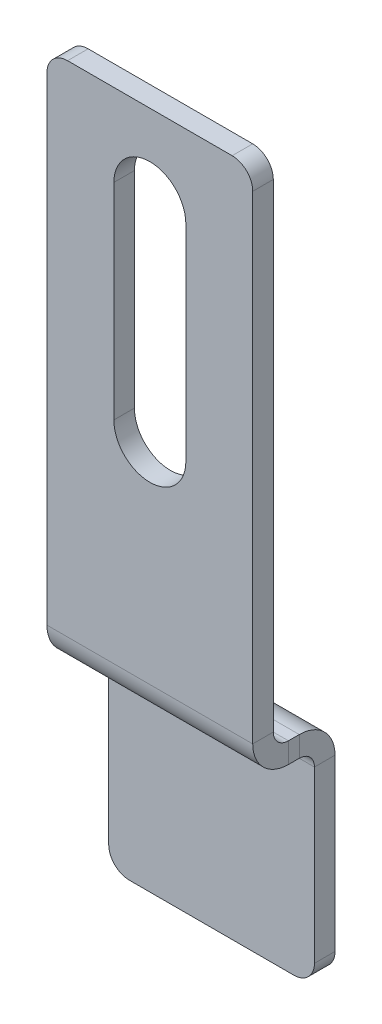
ISO-10303-21;
HEADER;
FILE_DESCRIPTION(('STEP AP214'),'2;1');
FILE_NAME('part.step','',(''),(''),'','','');
FILE_SCHEMA(('AUTOMOTIVE_DESIGN { 1 0 10303 214 1 1 1 1 }'));
ENDSEC;
DATA;
#1=APPLICATION_CONTEXT('core data for automotive mechanical design processes');
#2=APPLICATION_PROTOCOL_DEFINITION('international standard','automotive_design',2000,#1);
#3=PRODUCT_CONTEXT('',#1,'mechanical');
#4=PRODUCT('Part','Part','',(#3));
#5=PRODUCT_RELATED_PRODUCT_CATEGORY('part','',(#4));
#6=PRODUCT_DEFINITION_FORMATION('','',#4);
#7=PRODUCT_DEFINITION_CONTEXT('part definition',#1,'design');
#8=PRODUCT_DEFINITION('design','',#6,#7);
#9=PRODUCT_DEFINITION_SHAPE('','',#8);
#10=(LENGTH_UNIT() NAMED_UNIT(*) SI_UNIT(.MILLI.,.METRE.));
#11=(NAMED_UNIT(*) PLANE_ANGLE_UNIT() SI_UNIT($,.RADIAN.));
#12=(NAMED_UNIT(*) SI_UNIT($,.STERADIAN.) SOLID_ANGLE_UNIT());
#13=UNCERTAINTY_MEASURE_WITH_UNIT(LENGTH_MEASURE(1.E-05),#10,'distance_accuracy_value','');
#14=(GEOMETRIC_REPRESENTATION_CONTEXT(3) GLOBAL_UNCERTAINTY_ASSIGNED_CONTEXT((#13)) GLOBAL_UNIT_ASSIGNED_CONTEXT((#10,
#11,#12)) REPRESENTATION_CONTEXT('',''));
#15=CARTESIAN_POINT('',(0.,0.,0.));
#16=DIRECTION('',(0.,0.,1.));
#17=DIRECTION('',(1.,0.,0.));
#18=AXIS2_PLACEMENT_3D('',#15,#16,#17);
#19=CARTESIAN_POINT('',(10.,-25.,-0.736600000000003));
#20=DIRECTION('',(1.,0.,0.));
#21=DIRECTION('',(0.,0.,-1.));
#22=AXIS2_PLACEMENT_3D('',#19,#20,#21);
#23=PLANE('',#22);
#24=DIRECTION('',(0.,-1.,0.));
#25=VECTOR('',#24,1.);
#26=CARTESIAN_POINT('',(10.,-25.,-0.736600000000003));
#27=LINE('',#26,#25);
#28=CARTESIAN_POINT('',(10.,-25.,-0.736600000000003));
#29=VERTEX_POINT('',#28);
#30=CARTESIAN_POINT('',(10.,-26.,-0.736600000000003));
#31=VERTEX_POINT('',#30);
#32=EDGE_CURVE('E323',#29,#31,#27,.T.);
#33=ORIENTED_EDGE('',*,*,#32,.F.);
#34=CARTESIAN_POINT('',(10.,-24.2634,-0.736600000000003));
#35=DIRECTION('',(-1.,0.,0.));
#36=DIRECTION('',(0.,0.,1.));
#37=AXIS2_PLACEMENT_3D('',#34,#35,#36);
#38=CIRCLE('',#37,0.7366);
#39=CARTESIAN_POINT('',(10.,-24.2634,0.));
#40=VERTEX_POINT('',#39);
#41=EDGE_CURVE('E230',#40,#29,#38,.F.);
#42=ORIENTED_EDGE('',*,*,#41,.F.);
#43=DIRECTION('',(0.,0.,-1.));
#44=VECTOR('',#43,1.);
#45=CARTESIAN_POINT('',(10.,-24.2634,0.999999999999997));
#46=LINE('',#45,#44);
#47=CARTESIAN_POINT('',(10.,-24.2634,0.999999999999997));
#48=VERTEX_POINT('',#47);
#49=EDGE_CURVE('E320',#48,#40,#46,.T.);
#50=ORIENTED_EDGE('',*,*,#49,.F.);
#51=CARTESIAN_POINT('',(10.,-24.2634,-0.736600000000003));
#52=DIRECTION('',(1.,0.,0.));
#53=DIRECTION('',(0.,0.,-1.));
#54=AXIS2_PLACEMENT_3D('',#51,#52,#53);
#55=CIRCLE('',#54,1.7366);
#56=EDGE_CURVE('E237',#48,#31,#55,.T.);
#57=ORIENTED_EDGE('',*,*,#56,.T.);
#58=EDGE_LOOP('',(#33,#42,#50,#57));
#59=FACE_BOUND('',#58,.T.);
#60=ADVANCED_FACE('F36',(#59),#23,.T.);
#61=CARTESIAN_POINT('',(10.,-24.2634,0.999999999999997));
#62=DIRECTION('',(1.,0.,0.));
#63=DIRECTION('',(0.,0.,-1.));
#64=AXIS2_PLACEMENT_3D('',#61,#62,#63);
#65=PLANE('',#64);
#66=DIRECTION('',(0.,0.,-1.));
#67=VECTOR('',#66,1.);
#68=CARTESIAN_POINT('',(10.,-25.,0.));
#69=LINE('',#68,#67);
#70=CARTESIAN_POINT('',(10.,-25.,-1.2634));
#71=VERTEX_POINT('',#70);
#72=EDGE_CURVE('E227',#29,#71,#69,.T.);
#73=ORIENTED_EDGE('',*,*,#72,.F.);
#74=ORIENTED_EDGE('',*,*,#32,.T.);
#75=DIRECTION('',(0.,0.,-1.));
#76=VECTOR('',#75,1.);
#77=CARTESIAN_POINT('',(10.,-26.,0.));
#78=LINE('',#77,#76);
#79=CARTESIAN_POINT('',(10.,-26.,-1.2634));
#80=VERTEX_POINT('',#79);
#81=EDGE_CURVE('E240',#31,#80,#78,.T.);
#82=ORIENTED_EDGE('',*,*,#81,.T.);
#83=DIRECTION('',(0.,1.,0.));
#84=VECTOR('',#83,1.);
#85=CARTESIAN_POINT('',(10.,-26.,-1.2634));
#86=LINE('',#85,#84);
#87=EDGE_CURVE('E311',#80,#71,#86,.T.);
#88=ORIENTED_EDGE('',*,*,#87,.T.);
#89=EDGE_LOOP('',(#73,#74,#82,#88));
#90=FACE_BOUND('',#89,.T.);
#91=ADVANCED_FACE('F382',(#90),#65,.T.);
#92=CARTESIAN_POINT('',(0.,-24.2634,0.));
#93=DIRECTION('',(-1.,0.,0.));
#94=DIRECTION('',(0.,0.,1.));
#95=AXIS2_PLACEMENT_3D('',#92,#93,#94);
#96=PLANE('',#95);
#97=DIRECTION('',(0.,0.,1.));
#98=VECTOR('',#97,1.);
#99=CARTESIAN_POINT('',(0.,-24.2634,0.));
#100=LINE('',#99,#98);
#101=CARTESIAN_POINT('',(0.,-24.2634,0.));
#102=VERTEX_POINT('',#101);
#103=CARTESIAN_POINT('',(0.,-24.2634,0.999999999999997));
#104=VERTEX_POINT('',#103);
#105=EDGE_CURVE('E317',#102,#104,#100,.T.);
#106=ORIENTED_EDGE('',*,*,#105,.F.);
#107=CARTESIAN_POINT('',(0.,-24.2634,-0.736600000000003));
#108=DIRECTION('',(-1.,0.,0.));
#109=DIRECTION('',(0.,0.,1.));
#110=AXIS2_PLACEMENT_3D('',#107,#108,#109);
#111=CIRCLE('',#110,0.7366);
#112=CARTESIAN_POINT('',(0.,-25.,-0.736600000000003));
#113=VERTEX_POINT('',#112);
#114=EDGE_CURVE('E258',#102,#113,#111,.F.);
#115=ORIENTED_EDGE('',*,*,#114,.T.);
#116=DIRECTION('',(0.,1.,0.));
#117=VECTOR('',#116,1.);
#118=CARTESIAN_POINT('',(0.,-26.,-0.736600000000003));
#119=LINE('',#118,#117);
#120=CARTESIAN_POINT('',(0.,-26.,-0.736600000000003));
#121=VERTEX_POINT('',#120);
#122=EDGE_CURVE('E315',#121,#113,#119,.T.);
#123=ORIENTED_EDGE('',*,*,#122,.F.);
#124=CARTESIAN_POINT('',(0.,-24.2634,-0.736600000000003));
#125=DIRECTION('',(1.,0.,0.));
#126=DIRECTION('',(0.,0.,-1.));
#127=AXIS2_PLACEMENT_3D('',#124,#125,#126);
#128=CIRCLE('',#127,1.7366);
#129=EDGE_CURVE('E265',#104,#121,#128,.T.);
#130=ORIENTED_EDGE('',*,*,#129,.F.);
#131=EDGE_LOOP('',(#106,#115,#123,#130));
#132=FACE_BOUND('',#131,.T.);
#133=ADVANCED_FACE('F441',(#132),#96,.T.);
#134=CARTESIAN_POINT('',(0.,-26.,-0.736600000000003));
#135=DIRECTION('',(-1.,0.,0.));
#136=DIRECTION('',(0.,0.,1.));
#137=AXIS2_PLACEMENT_3D('',#134,#135,#136);
#138=PLANE('',#137);
#139=DIRECTION('',(0.,-1.,0.));
#140=VECTOR('',#139,1.);
#141=CARTESIAN_POINT('',(0.,0.,1.));
#142=LINE('',#141,#140);
#143=CARTESIAN_POINT('',(0.,-1.,1.));
#144=VERTEX_POINT('',#143);
#145=EDGE_CURVE('E263',#144,#104,#142,.T.);
#146=ORIENTED_EDGE('',*,*,#145,.F.);
#147=DIRECTION('',(0.,0.,-1.));
#148=VECTOR('',#147,1.);
#149=CARTESIAN_POINT('',(0.,-1.,-0.7366));
#150=LINE('',#149,#148);
#151=CARTESIAN_POINT('',(0.,-1.,0.));
#152=VERTEX_POINT('',#151);
#153=EDGE_CURVE('E11',#144,#152,#150,.T.);
#154=ORIENTED_EDGE('',*,*,#153,.T.);
#155=DIRECTION('',(0.,-1.,0.));
#156=VECTOR('',#155,1.);
#157=CARTESIAN_POINT('',(0.,0.,0.));
#158=LINE('',#157,#156);
#159=EDGE_CURVE('E261',#152,#102,#158,.T.);
#160=ORIENTED_EDGE('',*,*,#159,.T.);
#161=ORIENTED_EDGE('',*,*,#105,.T.);
#162=EDGE_LOOP('',(#146,#154,#160,#161));
#163=FACE_BOUND('',#162,.T.);
#164=ADVANCED_FACE('F457',(#163),#138,.T.);
#165=CARTESIAN_POINT('',(10.,-26.7366,-3.));
#166=DIRECTION('',(1.,0.,0.));
#167=DIRECTION('',(0.,0.,-1.));
#168=AXIS2_PLACEMENT_3D('',#165,#166,#167);
#169=PLANE('',#168);
#170=DIRECTION('',(0.,0.,1.));
#171=VECTOR('',#170,1.);
#172=CARTESIAN_POINT('',(10.,-26.7366,-3.));
#173=LINE('',#172,#171);
#174=CARTESIAN_POINT('',(10.,-26.7366,-3.));
#175=VERTEX_POINT('',#174);
#176=CARTESIAN_POINT('',(10.,-26.7366,-2.));
#177=VERTEX_POINT('',#176);
#178=EDGE_CURVE('E313',#175,#177,#173,.T.);
#179=ORIENTED_EDGE('',*,*,#178,.F.);
#180=CARTESIAN_POINT('',(10.,-26.7366,-1.2634));
#181=DIRECTION('',(1.,0.,0.));
#182=DIRECTION('',(0.,0.,-1.));
#183=AXIS2_PLACEMENT_3D('',#180,#181,#182);
#184=CIRCLE('',#183,1.7366);
#185=EDGE_CURVE('E224',#71,#175,#184,.F.);
#186=ORIENTED_EDGE('',*,*,#185,.F.);
#187=ORIENTED_EDGE('',*,*,#87,.F.);
#188=CARTESIAN_POINT('',(10.,-26.7366,-1.2634));
#189=DIRECTION('',(1.,0.,0.));
#190=DIRECTION('',(0.,0.,-1.));
#191=AXIS2_PLACEMENT_3D('',#188,#189,#190);
#192=CIRCLE('',#191,0.7366);
#193=EDGE_CURVE('E243',#80,#177,#192,.F.);
#194=ORIENTED_EDGE('',*,*,#193,.T.);
#195=EDGE_LOOP('',(#179,#186,#187,#194));
#196=FACE_BOUND('',#195,.T.);
#197=ADVANCED_FACE('F391',(#196),#169,.T.);
#198=CARTESIAN_POINT('',(10.,-26.,-1.2634));
#199=DIRECTION('',(1.,0.,0.));
#200=DIRECTION('',(0.,0.,-1.));
#201=AXIS2_PLACEMENT_3D('',#198,#199,#200);
#202=PLANE('',#201);
#203=DIRECTION('',(0.,-1.,0.));
#204=VECTOR('',#203,1.);
#205=CARTESIAN_POINT('',(10.,-25.,-2.));
#206=LINE('',#205,#204);
#207=CARTESIAN_POINT('',(10.,-35.,-2.));
#208=VERTEX_POINT('',#207);
#209=EDGE_CURVE('E217',#177,#208,#206,.T.);
#210=ORIENTED_EDGE('',*,*,#209,.T.);
#211=DIRECTION('',(0.,0.,1.));
#212=VECTOR('',#211,1.);
#213=CARTESIAN_POINT('',(10.,-35.,-1.2634));
#214=LINE('',#213,#212);
#215=CARTESIAN_POINT('',(10.,-35.,-3.));
#216=VERTEX_POINT('',#215);
#217=EDGE_CURVE('E334',#208,#216,#214,.F.);
#218=ORIENTED_EDGE('',*,*,#217,.T.);
#219=DIRECTION('',(0.,-1.,0.));
#220=VECTOR('',#219,1.);
#221=CARTESIAN_POINT('',(10.,-25.,-3.));
#222=LINE('',#221,#220);
#223=EDGE_CURVE('E220',#175,#216,#222,.T.);
#224=ORIENTED_EDGE('',*,*,#223,.F.);
#225=ORIENTED_EDGE('',*,*,#178,.T.);
#226=EDGE_LOOP('',(#210,#218,#224,#225));
#227=FACE_BOUND('',#226,.T.);
#228=ADVANCED_FACE('F401',(#227),#202,.T.);
#229=CARTESIAN_POINT('',(0.,-25.,-1.2634));
#230=DIRECTION('',(-1.,0.,0.));
#231=DIRECTION('',(0.,0.,1.));
#232=AXIS2_PLACEMENT_3D('',#229,#230,#231);
#233=PLANE('',#232);
#234=DIRECTION('',(0.,-1.,0.));
#235=VECTOR('',#234,1.);
#236=CARTESIAN_POINT('',(0.,-25.,-1.2634));
#237=LINE('',#236,#235);
#238=CARTESIAN_POINT('',(0.,-25.,-1.2634));
#239=VERTEX_POINT('',#238);
#240=CARTESIAN_POINT('',(0.,-26.,-1.2634));
#241=VERTEX_POINT('',#240);
#242=EDGE_CURVE('E309',#239,#241,#237,.T.);
#243=ORIENTED_EDGE('',*,*,#242,.F.);
#244=CARTESIAN_POINT('',(0.,-26.7366,-1.2634));
#245=DIRECTION('',(1.,0.,0.));
#246=DIRECTION('',(0.,0.,-1.));
#247=AXIS2_PLACEMENT_3D('',#244,#245,#246);
#248=CIRCLE('',#247,1.7366);
#249=CARTESIAN_POINT('',(0.,-26.7366,-3.));
#250=VERTEX_POINT('',#249);
#251=EDGE_CURVE('E252',#239,#250,#248,.F.);
#252=ORIENTED_EDGE('',*,*,#251,.T.);
#253=DIRECTION('',(0.,0.,-1.));
#254=VECTOR('',#253,1.);
#255=CARTESIAN_POINT('',(0.,-26.7366,-2.));
#256=LINE('',#255,#254);
#257=CARTESIAN_POINT('',(0.,-26.7366,-2.));
#258=VERTEX_POINT('',#257);
#259=EDGE_CURVE('E307',#258,#250,#256,.T.);
#260=ORIENTED_EDGE('',*,*,#259,.F.);
#261=CARTESIAN_POINT('',(0.,-26.7366,-1.2634));
#262=DIRECTION('',(1.,0.,0.));
#263=DIRECTION('',(0.,0.,-1.));
#264=AXIS2_PLACEMENT_3D('',#261,#262,#263);
#265=CIRCLE('',#264,0.7366);
#266=EDGE_CURVE('E221',#241,#258,#265,.F.);
#267=ORIENTED_EDGE('',*,*,#266,.F.);
#268=EDGE_LOOP('',(#243,#252,#260,#267));
#269=FACE_BOUND('',#268,.T.);
#270=ADVANCED_FACE('F421',(#269),#233,.T.);
#271=CARTESIAN_POINT('',(0.,-26.7366,-2.));
#272=DIRECTION('',(-1.,0.,0.));
#273=DIRECTION('',(0.,0.,1.));
#274=AXIS2_PLACEMENT_3D('',#271,#272,#273);
#275=PLANE('',#274);
#276=DIRECTION('',(0.,0.,-1.));
#277=VECTOR('',#276,1.);
#278=CARTESIAN_POINT('',(0.,-25.,0.));
#279=LINE('',#278,#277);
#280=EDGE_CURVE('E255',#113,#239,#279,.T.);
#281=ORIENTED_EDGE('',*,*,#280,.T.);
#282=ORIENTED_EDGE('',*,*,#242,.T.);
#283=DIRECTION('',(0.,0.,-1.));
#284=VECTOR('',#283,1.);
#285=CARTESIAN_POINT('',(0.,-26.,0.));
#286=LINE('',#285,#284);
#287=EDGE_CURVE('E268',#121,#241,#286,.T.);
#288=ORIENTED_EDGE('',*,*,#287,.F.);
#289=ORIENTED_EDGE('',*,*,#122,.T.);
#290=EDGE_LOOP('',(#281,#282,#288,#289));
#291=FACE_BOUND('',#290,.T.);
#292=ADVANCED_FACE('F427',(#291),#275,.T.);
#293=CARTESIAN_POINT('',(10.,-25.,-2.));
#294=DIRECTION('',(0.,0.,-1.));
#295=DIRECTION('',(0.,1.,0.));
#296=AXIS2_PLACEMENT_3D('',#293,#294,#295);
#297=PLANE('',#296);
#298=DIRECTION('',(-1.,0.,0.));
#299=VECTOR('',#298,1.);
#300=CARTESIAN_POINT('',(10.,-36.,-2.));
#301=LINE('',#300,#299);
#302=CARTESIAN_POINT('',(9.,-36.,-2.));
#303=VERTEX_POINT('',#302);
#304=CARTESIAN_POINT('',(0.999999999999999,-36.,-2.));
#305=VERTEX_POINT('',#304);
#306=EDGE_CURVE('E304',#303,#305,#301,.T.);
#307=ORIENTED_EDGE('',*,*,#306,.F.);
#308=CARTESIAN_POINT('',(9.,-35.,-2.));
#309=DIRECTION('',(0.,0.,-1.));
#310=DIRECTION('',(0.,1.,0.));
#311=AXIS2_PLACEMENT_3D('',#308,#309,#310);
#312=CIRCLE('',#311,1.);
#313=EDGE_CURVE('E332',#303,#208,#312,.F.);
#314=ORIENTED_EDGE('',*,*,#313,.T.);
#315=ORIENTED_EDGE('',*,*,#209,.F.);
#316=DIRECTION('',(-1.,0.,0.));
#317=VECTOR('',#316,1.);
#318=CARTESIAN_POINT('',(10.,-26.7366,-2.));
#319=LINE('',#318,#317);
#320=EDGE_CURVE('E246',#177,#258,#319,.T.);
#321=ORIENTED_EDGE('',*,*,#320,.T.);
#322=DIRECTION('',(0.,-1.,0.));
#323=VECTOR('',#322,1.);
#324=CARTESIAN_POINT('',(0.,-25.,-2.));
#325=LINE('',#324,#323);
#326=CARTESIAN_POINT('',(0.,-35.,-2.));
#327=VERTEX_POINT('',#326);
#328=EDGE_CURVE('E216',#258,#327,#325,.T.);
#329=ORIENTED_EDGE('',*,*,#328,.T.);
#330=CARTESIAN_POINT('',(1.,-35.,-2.));
#331=DIRECTION('',(0.,0.,-1.));
#332=DIRECTION('',(0.,1.,0.));
#333=AXIS2_PLACEMENT_3D('',#330,#331,#332);
#334=CIRCLE('',#333,1.);
#335=EDGE_CURVE('E330',#327,#305,#334,.F.);
#336=ORIENTED_EDGE('',*,*,#335,.T.);
#337=EDGE_LOOP('',(#307,#314,#315,#321,#329,#336));
#338=FACE_BOUND('',#337,.T.);
#339=ADVANCED_FACE('F425',(#338),#297,.F.);
#340=CARTESIAN_POINT('',(10.,-36.,-3.));
#341=DIRECTION('',(0.,-1.,0.));
#342=DIRECTION('',(0.,0.,-1.));
#343=AXIS2_PLACEMENT_3D('',#340,#341,#342);
#344=PLANE('',#343);
#345=DIRECTION('',(-1.,0.,0.));
#346=VECTOR('',#345,1.);
#347=CARTESIAN_POINT('',(10.,-36.,-3.));
#348=LINE('',#347,#346);
#349=CARTESIAN_POINT('',(9.,-36.,-3.));
#350=VERTEX_POINT('',#349);
#351=CARTESIAN_POINT('',(0.999999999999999,-36.,-3.));
#352=VERTEX_POINT('',#351);
#353=EDGE_CURVE('E301',#350,#352,#348,.T.);
#354=ORIENTED_EDGE('',*,*,#353,.F.);
#355=DIRECTION('',(0.,0.,1.));
#356=VECTOR('',#355,1.);
#357=CARTESIAN_POINT('',(9.,-36.,-3.));
#358=LINE('',#357,#356);
#359=EDGE_CURVE('E327',#350,#303,#358,.T.);
#360=ORIENTED_EDGE('',*,*,#359,.T.);
#361=ORIENTED_EDGE('',*,*,#306,.T.);
#362=DIRECTION('',(0.,0.,1.));
#363=VECTOR('',#362,1.);
#364=CARTESIAN_POINT('',(1.,-36.,-3.));
#365=LINE('',#364,#363);
#366=EDGE_CURVE('E325',#305,#352,#365,.F.);
#367=ORIENTED_EDGE('',*,*,#366,.T.);
#368=EDGE_LOOP('',(#354,#360,#361,#367));
#369=FACE_BOUND('',#368,.T.);
#370=ADVANCED_FACE('F410',(#369),#344,.T.);
#371=CARTESIAN_POINT('',(10.,-25.,-3.));
#372=DIRECTION('',(0.,0.,-1.));
#373=DIRECTION('',(0.,1.,0.));
#374=AXIS2_PLACEMENT_3D('',#371,#372,#373);
#375=PLANE('',#374);
#376=ORIENTED_EDGE('',*,*,#223,.T.);
#377=CARTESIAN_POINT('',(9.,-35.,-3.));
#378=DIRECTION('',(0.,0.,-1.));
#379=DIRECTION('',(0.,1.,0.));
#380=AXIS2_PLACEMENT_3D('',#377,#378,#379);
#381=CIRCLE('',#380,1.);
#382=EDGE_CURVE('E338',#216,#350,#381,.T.);
#383=ORIENTED_EDGE('',*,*,#382,.T.);
#384=ORIENTED_EDGE('',*,*,#353,.T.);
#385=CARTESIAN_POINT('',(1.,-35.,-3.));
#386=DIRECTION('',(0.,0.,-1.));
#387=DIRECTION('',(0.,1.,0.));
#388=AXIS2_PLACEMENT_3D('',#385,#386,#387);
#389=CIRCLE('',#388,1.);
#390=CARTESIAN_POINT('',(0.,-35.,-3.));
#391=VERTEX_POINT('',#390);
#392=EDGE_CURVE('E336',#352,#391,#389,.T.);
#393=ORIENTED_EDGE('',*,*,#392,.T.);
#394=DIRECTION('',(0.,-1.,0.));
#395=VECTOR('',#394,1.);
#396=CARTESIAN_POINT('',(0.,-25.,-3.));
#397=LINE('',#396,#395);
#398=EDGE_CURVE('E249',#250,#391,#397,.T.);
#399=ORIENTED_EDGE('',*,*,#398,.F.);
#400=DIRECTION('',(-1.,0.,0.));
#401=VECTOR('',#400,1.);
#402=CARTESIAN_POINT('',(10.,-26.7366,-3.));
#403=LINE('',#402,#401);
#404=EDGE_CURVE('E298',#175,#250,#403,.T.);
#405=ORIENTED_EDGE('',*,*,#404,.F.);
#406=EDGE_LOOP('',(#376,#383,#384,#393,#399,#405));
#407=FACE_BOUND('',#406,.T.);
#408=ADVANCED_FACE('F399',(#407),#375,.T.);
#409=CARTESIAN_POINT('',(10.,-26.7366,-1.2634));
#410=DIRECTION('',(-1.,0.,0.));
#411=DIRECTION('',(0.,0.,1.));
#412=AXIS2_PLACEMENT_3D('',#409,#410,#411);
#413=CYLINDRICAL_SURFACE('',#412,1.7366);
#414=ORIENTED_EDGE('',*,*,#251,.F.);
#415=DIRECTION('',(-1.,0.,0.));
#416=VECTOR('',#415,1.);
#417=CARTESIAN_POINT('',(10.,-25.,-1.2634));
#418=LINE('',#417,#416);
#419=EDGE_CURVE('E295',#71,#239,#418,.T.);
#420=ORIENTED_EDGE('',*,*,#419,.F.);
#421=ORIENTED_EDGE('',*,*,#185,.T.);
#422=ORIENTED_EDGE('',*,*,#404,.T.);
#423=EDGE_LOOP('',(#414,#420,#421,#422));
#424=FACE_BOUND('',#423,.T.);
#425=ADVANCED_FACE('F390',(#424),#413,.T.);
#426=CARTESIAN_POINT('',(10.,-25.,0.));
#427=DIRECTION('',(0.,1.,0.));
#428=DIRECTION('',(0.,0.,1.));
#429=AXIS2_PLACEMENT_3D('',#426,#427,#428);
#430=PLANE('',#429);
#431=ORIENTED_EDGE('',*,*,#280,.F.);
#432=DIRECTION('',(-1.,0.,0.));
#433=VECTOR('',#432,1.);
#434=CARTESIAN_POINT('',(10.,-25.,-0.736600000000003));
#435=LINE('',#434,#433);
#436=EDGE_CURVE('E292',#29,#113,#435,.T.);
#437=ORIENTED_EDGE('',*,*,#436,.F.);
#438=ORIENTED_EDGE('',*,*,#72,.T.);
#439=ORIENTED_EDGE('',*,*,#419,.T.);
#440=EDGE_LOOP('',(#431,#437,#438,#439));
#441=FACE_BOUND('',#440,.T.);
#442=ADVANCED_FACE('F381',(#441),#430,.T.);
#443=CARTESIAN_POINT('',(10.,-24.2634,-0.736600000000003));
#444=DIRECTION('',(-1.,0.,0.));
#445=DIRECTION('',(0.,0.,1.));
#446=AXIS2_PLACEMENT_3D('',#443,#444,#445);
#447=CYLINDRICAL_SURFACE('',#446,0.7366);
#448=ORIENTED_EDGE('',*,*,#114,.F.);
#449=DIRECTION('',(-1.,0.,0.));
#450=VECTOR('',#449,1.);
#451=CARTESIAN_POINT('',(10.,-24.2634,0.));
#452=LINE('',#451,#450);
#453=EDGE_CURVE('E289',#40,#102,#452,.T.);
#454=ORIENTED_EDGE('',*,*,#453,.F.);
#455=ORIENTED_EDGE('',*,*,#41,.T.);
#456=ORIENTED_EDGE('',*,*,#436,.T.);
#457=EDGE_LOOP('',(#448,#454,#455,#456));
#458=FACE_BOUND('',#457,.T.);
#459=ADVANCED_FACE('F372',(#458),#447,.F.);
#460=CARTESIAN_POINT('',(10.,0.,0.));
#461=DIRECTION('',(0.,0.,-1.));
#462=DIRECTION('',(0.,1.,0.));
#463=AXIS2_PLACEMENT_3D('',#460,#461,#462);
#464=PLANE('',#463);
#465=CARTESIAN_POINT('',(5.,-4.,0.));
#466=DIRECTION('',(0.,0.,-1.));
#467=DIRECTION('',(0.,1.,0.));
#468=AXIS2_PLACEMENT_3D('',#465,#466,#467);
#469=CIRCLE('',#468,1.75);
#470=CARTESIAN_POINT('',(3.25,-4.,0.));
#471=VERTEX_POINT('',#470);
#472=CARTESIAN_POINT('',(6.75,-4.,0.));
#473=VERTEX_POINT('',#472);
#474=EDGE_CURVE('E214',#471,#473,#469,.T.);
#475=ORIENTED_EDGE('',*,*,#474,.F.);
#476=DIRECTION('',(0.,1.,0.));
#477=VECTOR('',#476,1.);
#478=CARTESIAN_POINT('',(3.25,0.,0.));
#479=LINE('',#478,#477);
#480=CARTESIAN_POINT('',(3.25,-14.,0.));
#481=VERTEX_POINT('',#480);
#482=EDGE_CURVE('E207',#481,#471,#479,.T.);
#483=ORIENTED_EDGE('',*,*,#482,.F.);
#484=CARTESIAN_POINT('',(5.,-14.,0.));
#485=DIRECTION('',(0.,0.,-1.));
#486=DIRECTION('',(0.,1.,0.));
#487=AXIS2_PLACEMENT_3D('',#484,#485,#486);
#488=CIRCLE('',#487,1.75);
#489=CARTESIAN_POINT('',(6.75,-14.,0.));
#490=VERTEX_POINT('',#489);
#491=EDGE_CURVE('E183',#490,#481,#488,.T.);
#492=ORIENTED_EDGE('',*,*,#491,.F.);
#493=DIRECTION('',(0.,-1.,0.));
#494=VECTOR('',#493,1.);
#495=CARTESIAN_POINT('',(6.75,0.,0.));
#496=LINE('',#495,#494);
#497=EDGE_CURVE('E212',#473,#490,#496,.T.);
#498=ORIENTED_EDGE('',*,*,#497,.F.);
#499=EDGE_LOOP('',(#475,#483,#492,#498));
#500=FACE_BOUND('',#499,.T.);
#501=DIRECTION('',(-1.,0.,0.));
#502=VECTOR('',#501,1.);
#503=CARTESIAN_POINT('',(10.,0.,0.));
#504=LINE('',#503,#502);
#505=CARTESIAN_POINT('',(9.,0.,0.));
#506=VERTEX_POINT('',#505);
#507=CARTESIAN_POINT('',(0.999999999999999,0.,0.));
#508=VERTEX_POINT('',#507);
#509=EDGE_CURVE('E286',#506,#508,#504,.T.);
#510=ORIENTED_EDGE('',*,*,#509,.F.);
#511=CARTESIAN_POINT('',(9.,-1.,0.));
#512=DIRECTION('',(0.,0.,-1.));
#513=DIRECTION('',(0.,1.,0.));
#514=AXIS2_PLACEMENT_3D('',#511,#512,#513);
#515=CIRCLE('',#514,1.);
#516=CARTESIAN_POINT('',(10.,-1.,0.));
#517=VERTEX_POINT('',#516);
#518=EDGE_CURVE('E350',#506,#517,#515,.T.);
#519=ORIENTED_EDGE('',*,*,#518,.T.);
#520=DIRECTION('',(0.,-1.,0.));
#521=VECTOR('',#520,1.);
#522=CARTESIAN_POINT('',(10.,0.,0.));
#523=LINE('',#522,#521);
#524=EDGE_CURVE('E233',#517,#40,#523,.T.);
#525=ORIENTED_EDGE('',*,*,#524,.T.);
#526=ORIENTED_EDGE('',*,*,#453,.T.);
#527=ORIENTED_EDGE('',*,*,#159,.F.);
#528=CARTESIAN_POINT('',(1.,-1.,0.));
#529=DIRECTION('',(0.,0.,-1.));
#530=DIRECTION('',(0.,1.,0.));
#531=AXIS2_PLACEMENT_3D('',#528,#529,#530);
#532=CIRCLE('',#531,1.);
#533=EDGE_CURVE('E348',#152,#508,#532,.T.);
#534=ORIENTED_EDGE('',*,*,#533,.T.);
#535=EDGE_LOOP('',(#510,#519,#525,#526,#527,#534));
#536=FACE_BOUND('',#535,.T.);
#537=ADVANCED_FACE('F364',(#500,#536),#464,.T.);
#538=CARTESIAN_POINT('',(10.,0.,1.));
#539=DIRECTION('',(0.,1.,0.));
#540=DIRECTION('',(0.,0.,1.));
#541=AXIS2_PLACEMENT_3D('',#538,#539,#540);
#542=PLANE('',#541);
#543=DIRECTION('',(-1.,0.,0.));
#544=VECTOR('',#543,1.);
#545=CARTESIAN_POINT('',(10.,0.,1.));
#546=LINE('',#545,#544);
#547=CARTESIAN_POINT('',(9.,0.,1.));
#548=VERTEX_POINT('',#547);
#549=CARTESIAN_POINT('',(0.999999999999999,0.,1.));
#550=VERTEX_POINT('',#549);
#551=EDGE_CURVE('E284',#548,#550,#546,.T.);
#552=ORIENTED_EDGE('',*,*,#551,.F.);
#553=DIRECTION('',(0.,0.,-1.));
#554=VECTOR('',#553,1.);
#555=CARTESIAN_POINT('',(9.,0.,1.));
#556=LINE('',#555,#554);
#557=EDGE_CURVE('E345',#548,#506,#556,.T.);
#558=ORIENTED_EDGE('',*,*,#557,.T.);
#559=ORIENTED_EDGE('',*,*,#509,.T.);
#560=DIRECTION('',(0.,0.,-1.));
#561=VECTOR('',#560,1.);
#562=CARTESIAN_POINT('',(0.999999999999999,0.,1.));
#563=LINE('',#562,#561);
#564=EDGE_CURVE('E343',#508,#550,#563,.F.);
#565=ORIENTED_EDGE('',*,*,#564,.T.);
#566=EDGE_LOOP('',(#552,#558,#559,#565));
#567=FACE_BOUND('',#566,.T.);
#568=ADVANCED_FACE('F359',(#567),#542,.T.);
#569=CARTESIAN_POINT('',(10.,0.,1.));
#570=DIRECTION('',(0.,0.,-1.));
#571=DIRECTION('',(0.,1.,0.));
#572=AXIS2_PLACEMENT_3D('',#569,#570,#571);
#573=PLANE('',#572);
#574=DIRECTION('',(0.,-1.,0.));
#575=VECTOR('',#574,1.);
#576=CARTESIAN_POINT('',(3.25,-4.,1.));
#577=LINE('',#576,#575);
#578=CARTESIAN_POINT('',(3.25,-4.,1.));
#579=VERTEX_POINT('',#578);
#580=CARTESIAN_POINT('',(3.25,-14.,1.));
#581=VERTEX_POINT('',#580);
#582=EDGE_CURVE('E191',#579,#581,#577,.T.);
#583=ORIENTED_EDGE('',*,*,#582,.F.);
#584=CARTESIAN_POINT('',(5.,-4.,1.));
#585=DIRECTION('',(0.,0.,1.));
#586=DIRECTION('',(1.,0.,0.));
#587=AXIS2_PLACEMENT_3D('',#584,#585,#586);
#588=CIRCLE('',#587,1.75);
#589=CARTESIAN_POINT('',(6.75,-4.,1.));
#590=VERTEX_POINT('',#589);
#591=EDGE_CURVE('E196',#590,#579,#588,.T.);
#592=ORIENTED_EDGE('',*,*,#591,.F.);
#593=DIRECTION('',(0.,1.,0.));
#594=VECTOR('',#593,1.);
#595=CARTESIAN_POINT('',(6.75,-4.,1.));
#596=LINE('',#595,#594);
#597=CARTESIAN_POINT('',(6.75,-14.,1.));
#598=VERTEX_POINT('',#597);
#599=EDGE_CURVE('E200',#598,#590,#596,.T.);
#600=ORIENTED_EDGE('',*,*,#599,.F.);
#601=CARTESIAN_POINT('',(5.,-14.,1.));
#602=DIRECTION('',(0.,0.,1.));
#603=DIRECTION('',(1.,0.,0.));
#604=AXIS2_PLACEMENT_3D('',#601,#602,#603);
#605=CIRCLE('',#604,1.75);
#606=EDGE_CURVE('E180',#581,#598,#605,.T.);
#607=ORIENTED_EDGE('',*,*,#606,.F.);
#608=EDGE_LOOP('',(#583,#592,#600,#607));
#609=FACE_BOUND('',#608,.T.);
#610=DIRECTION('',(0.,-1.,0.));
#611=VECTOR('',#610,1.);
#612=CARTESIAN_POINT('',(10.,0.,1.));
#613=LINE('',#612,#611);
#614=CARTESIAN_POINT('',(10.,-1.,1.));
#615=VERTEX_POINT('',#614);
#616=EDGE_CURVE('E235',#615,#48,#613,.T.);
#617=ORIENTED_EDGE('',*,*,#616,.F.);
#618=CARTESIAN_POINT('',(9.,-1.,1.));
#619=DIRECTION('',(0.,0.,-1.));
#620=DIRECTION('',(0.,1.,0.));
#621=AXIS2_PLACEMENT_3D('',#618,#619,#620);
#622=CIRCLE('',#621,1.);
#623=EDGE_CURVE('E44',#615,#548,#622,.F.);
#624=ORIENTED_EDGE('',*,*,#623,.T.);
#625=ORIENTED_EDGE('',*,*,#551,.T.);
#626=CARTESIAN_POINT('',(1.,-1.,1.));
#627=DIRECTION('',(0.,0.,-1.));
#628=DIRECTION('',(0.,1.,0.));
#629=AXIS2_PLACEMENT_3D('',#626,#627,#628);
#630=CIRCLE('',#629,1.);
#631=EDGE_CURVE('E51',#550,#144,#630,.F.);
#632=ORIENTED_EDGE('',*,*,#631,.T.);
#633=ORIENTED_EDGE('',*,*,#145,.T.);
#634=DIRECTION('',(-1.,0.,0.));
#635=VECTOR('',#634,1.);
#636=CARTESIAN_POINT('',(10.,-24.2634,0.999999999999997));
#637=LINE('',#636,#635);
#638=EDGE_CURVE('E281',#48,#104,#637,.T.);
#639=ORIENTED_EDGE('',*,*,#638,.F.);
#640=EDGE_LOOP('',(#617,#624,#625,#632,#633,#639));
#641=FACE_BOUND('',#640,.T.);
#642=ADVANCED_FACE('F198',(#609,#641),#573,.F.);
#643=CARTESIAN_POINT('',(10.,-24.2634,-0.736600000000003));
#644=DIRECTION('',(-1.,0.,0.));
#645=DIRECTION('',(0.,0.,1.));
#646=AXIS2_PLACEMENT_3D('',#643,#644,#645);
#647=CYLINDRICAL_SURFACE('',#646,1.7366);
#648=ORIENTED_EDGE('',*,*,#129,.T.);
#649=DIRECTION('',(-1.,0.,0.));
#650=VECTOR('',#649,1.);
#651=CARTESIAN_POINT('',(10.,-26.,-0.736600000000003));
#652=LINE('',#651,#650);
#653=EDGE_CURVE('E278',#31,#121,#652,.T.);
#654=ORIENTED_EDGE('',*,*,#653,.F.);
#655=ORIENTED_EDGE('',*,*,#56,.F.);
#656=ORIENTED_EDGE('',*,*,#638,.T.);
#657=EDGE_LOOP('',(#648,#654,#655,#656));
#658=FACE_BOUND('',#657,.T.);
#659=ADVANCED_FACE('F461',(#658),#647,.T.);
#660=CARTESIAN_POINT('',(10.,-26.,0.));
#661=DIRECTION('',(0.,1.,0.));
#662=DIRECTION('',(0.,0.,1.));
#663=AXIS2_PLACEMENT_3D('',#660,#661,#662);
#664=PLANE('',#663);
#665=ORIENTED_EDGE('',*,*,#287,.T.);
#666=DIRECTION('',(-1.,0.,0.));
#667=VECTOR('',#666,1.);
#668=CARTESIAN_POINT('',(10.,-26.,-1.2634));
#669=LINE('',#668,#667);
#670=EDGE_CURVE('E275',#80,#241,#669,.T.);
#671=ORIENTED_EDGE('',*,*,#670,.F.);
#672=ORIENTED_EDGE('',*,*,#81,.F.);
#673=ORIENTED_EDGE('',*,*,#653,.T.);
#674=EDGE_LOOP('',(#665,#671,#672,#673));
#675=FACE_BOUND('',#674,.T.);
#676=ADVANCED_FACE('F464',(#675),#664,.F.);
#677=CARTESIAN_POINT('',(10.,-26.7366,-1.2634));
#678=DIRECTION('',(-1.,0.,0.));
#679=DIRECTION('',(0.,0.,1.));
#680=AXIS2_PLACEMENT_3D('',#677,#678,#679);
#681=CYLINDRICAL_SURFACE('',#680,0.7366);
#682=ORIENTED_EDGE('',*,*,#266,.T.);
#683=ORIENTED_EDGE('',*,*,#320,.F.);
#684=ORIENTED_EDGE('',*,*,#193,.F.);
#685=ORIENTED_EDGE('',*,*,#670,.T.);
#686=EDGE_LOOP('',(#682,#683,#684,#685));
#687=FACE_BOUND('',#686,.T.);
#688=ADVANCED_FACE('F423',(#687),#681,.F.);
#689=CARTESIAN_POINT('',(10.,-26.7366,-1.2634));
#690=DIRECTION('',(1.,0.,0.));
#691=DIRECTION('',(0.,0.,-1.));
#692=AXIS2_PLACEMENT_3D('',#689,#690,#691);
#693=PLANE('',#692);
#694=ORIENTED_EDGE('',*,*,#524,.F.);
#695=DIRECTION('',(0.,0.,-1.));
#696=VECTOR('',#695,1.);
#697=CARTESIAN_POINT('',(10.,-1.,-1.2634));
#698=LINE('',#697,#696);
#699=EDGE_CURVE('E59',#517,#615,#698,.F.);
#700=ORIENTED_EDGE('',*,*,#699,.T.);
#701=ORIENTED_EDGE('',*,*,#616,.T.);
#702=ORIENTED_EDGE('',*,*,#49,.T.);
#703=EDGE_LOOP('',(#694,#700,#701,#702));
#704=FACE_BOUND('',#703,.T.);
#705=ADVANCED_FACE('F365',(#704),#693,.T.);
#706=CARTESIAN_POINT('',(0.,-26.7366,-1.2634));
#707=DIRECTION('',(1.,0.,0.));
#708=DIRECTION('',(0.,0.,-1.));
#709=AXIS2_PLACEMENT_3D('',#706,#707,#708);
#710=PLANE('',#709);
#711=ORIENTED_EDGE('',*,*,#398,.T.);
#712=DIRECTION('',(0.,0.,1.));
#713=VECTOR('',#712,1.);
#714=CARTESIAN_POINT('',(0.,-35.,-2.));
#715=LINE('',#714,#713);
#716=EDGE_CURVE('E340',#391,#327,#715,.T.);
#717=ORIENTED_EDGE('',*,*,#716,.T.);
#718=ORIENTED_EDGE('',*,*,#328,.F.);
#719=ORIENTED_EDGE('',*,*,#259,.T.);
#720=EDGE_LOOP('',(#711,#717,#718,#719));
#721=FACE_BOUND('',#720,.T.);
#722=ADVANCED_FACE('F417',(#721),#710,.F.);
#723=CARTESIAN_POINT('',(5.,-4.,-3.));
#724=DIRECTION('',(0.,0.,1.));
#725=DIRECTION('',(1.,0.,0.));
#726=AXIS2_PLACEMENT_3D('',#723,#724,#725);
#727=CYLINDRICAL_SURFACE('',#726,1.75);
#728=ORIENTED_EDGE('',*,*,#474,.T.);
#729=DIRECTION('',(0.,0.,1.));
#730=VECTOR('',#729,1.);
#731=CARTESIAN_POINT('',(6.75,-4.,-3.));
#732=LINE('',#731,#730);
#733=EDGE_CURVE('E205',#473,#590,#732,.T.);
#734=ORIENTED_EDGE('',*,*,#733,.T.);
#735=ORIENTED_EDGE('',*,*,#591,.T.);
#736=DIRECTION('',(0.,0.,1.));
#737=VECTOR('',#736,1.);
#738=CARTESIAN_POINT('',(3.25,-4.,-3.));
#739=LINE('',#738,#737);
#740=EDGE_CURVE('E187',#471,#579,#739,.T.);
#741=ORIENTED_EDGE('',*,*,#740,.F.);
#742=EDGE_LOOP('',(#728,#734,#735,#741));
#743=FACE_BOUND('',#742,.T.);
#744=ADVANCED_FACE('F555',(#743),#727,.F.);
#745=CARTESIAN_POINT('',(6.75,-4.,-3.));
#746=DIRECTION('',(1.,0.,0.));
#747=DIRECTION('',(0.,1.,0.));
#748=AXIS2_PLACEMENT_3D('',#745,#746,#747);
#749=PLANE('',#748);
#750=ORIENTED_EDGE('',*,*,#497,.T.);
#751=DIRECTION('',(0.,0.,1.));
#752=VECTOR('',#751,1.);
#753=CARTESIAN_POINT('',(6.75,-14.,-3.));
#754=LINE('',#753,#752);
#755=EDGE_CURVE('E186',#490,#598,#754,.T.);
#756=ORIENTED_EDGE('',*,*,#755,.T.);
#757=ORIENTED_EDGE('',*,*,#599,.T.);
#758=ORIENTED_EDGE('',*,*,#733,.F.);
#759=EDGE_LOOP('',(#750,#756,#757,#758));
#760=FACE_BOUND('',#759,.T.);
#761=ADVANCED_FACE('F560',(#760),#749,.F.);
#762=CARTESIAN_POINT('',(5.,-14.,-3.));
#763=DIRECTION('',(0.,0.,1.));
#764=DIRECTION('',(1.,0.,0.));
#765=AXIS2_PLACEMENT_3D('',#762,#763,#764);
#766=CYLINDRICAL_SURFACE('',#765,1.75);
#767=ORIENTED_EDGE('',*,*,#491,.T.);
#768=DIRECTION('',(0.,0.,1.));
#769=VECTOR('',#768,1.);
#770=CARTESIAN_POINT('',(3.25,-14.,-3.));
#771=LINE('',#770,#769);
#772=EDGE_CURVE('E175',#481,#581,#771,.T.);
#773=ORIENTED_EDGE('',*,*,#772,.T.);
#774=ORIENTED_EDGE('',*,*,#606,.T.);
#775=ORIENTED_EDGE('',*,*,#755,.F.);
#776=EDGE_LOOP('',(#767,#773,#774,#775));
#777=FACE_BOUND('',#776,.T.);
#778=ADVANCED_FACE('F177',(#777),#766,.F.);
#779=CARTESIAN_POINT('',(3.25,-4.,-3.));
#780=DIRECTION('',(-1.,0.,0.));
#781=DIRECTION('',(0.,-1.,0.));
#782=AXIS2_PLACEMENT_3D('',#779,#780,#781);
#783=PLANE('',#782);
#784=ORIENTED_EDGE('',*,*,#482,.T.);
#785=ORIENTED_EDGE('',*,*,#740,.T.);
#786=ORIENTED_EDGE('',*,*,#582,.T.);
#787=ORIENTED_EDGE('',*,*,#772,.F.);
#788=EDGE_LOOP('',(#784,#785,#786,#787));
#789=FACE_BOUND('',#788,.T.);
#790=ADVANCED_FACE('F192',(#789),#783,.F.);
#791=CARTESIAN_POINT('',(9.,-35.,-3.));
#792=DIRECTION('',(0.,0.,1.));
#793=DIRECTION('',(1.,0.,0.));
#794=AXIS2_PLACEMENT_3D('',#791,#792,#793);
#795=CYLINDRICAL_SURFACE('',#794,1.);
#796=ORIENTED_EDGE('',*,*,#382,.F.);
#797=ORIENTED_EDGE('',*,*,#217,.F.);
#798=ORIENTED_EDGE('',*,*,#313,.F.);
#799=ORIENTED_EDGE('',*,*,#359,.F.);
#800=EDGE_LOOP('',(#796,#797,#798,#799));
#801=FACE_BOUND('',#800,.T.);
#802=ADVANCED_FACE('F405',(#801),#795,.T.);
#803=CARTESIAN_POINT('',(1.,-35.,-1.2634));
#804=DIRECTION('',(0.,0.,-1.));
#805=DIRECTION('',(-1.,0.,0.));
#806=AXIS2_PLACEMENT_3D('',#803,#804,#805);
#807=CYLINDRICAL_SURFACE('',#806,1.);
#808=ORIENTED_EDGE('',*,*,#392,.F.);
#809=ORIENTED_EDGE('',*,*,#366,.F.);
#810=ORIENTED_EDGE('',*,*,#335,.F.);
#811=ORIENTED_EDGE('',*,*,#716,.F.);
#812=EDGE_LOOP('',(#808,#809,#810,#811));
#813=FACE_BOUND('',#812,.T.);
#814=ADVANCED_FACE('F414',(#813),#807,.T.);
#815=CARTESIAN_POINT('',(9.,-1.,1.));
#816=DIRECTION('',(0.,0.,-1.));
#817=DIRECTION('',(0.,1.,0.));
#818=AXIS2_PLACEMENT_3D('',#815,#816,#817);
#819=CYLINDRICAL_SURFACE('',#818,1.);
#820=ORIENTED_EDGE('',*,*,#623,.F.);
#821=ORIENTED_EDGE('',*,*,#699,.F.);
#822=ORIENTED_EDGE('',*,*,#518,.F.);
#823=ORIENTED_EDGE('',*,*,#557,.F.);
#824=EDGE_LOOP('',(#820,#821,#822,#823));
#825=FACE_BOUND('',#824,.T.);
#826=ADVANCED_FACE('F362',(#825),#819,.T.);
#827=CARTESIAN_POINT('',(1.,-1.,-0.7366));
#828=DIRECTION('',(0.,0.,-1.));
#829=DIRECTION('',(0.,1.,0.));
#830=AXIS2_PLACEMENT_3D('',#827,#828,#829);
#831=CYLINDRICAL_SURFACE('',#830,1.);
#832=ORIENTED_EDGE('',*,*,#631,.F.);
#833=ORIENTED_EDGE('',*,*,#564,.F.);
#834=ORIENTED_EDGE('',*,*,#533,.F.);
#835=ORIENTED_EDGE('',*,*,#153,.F.);
#836=EDGE_LOOP('',(#832,#833,#834,#835));
#837=FACE_BOUND('',#836,.T.);
#838=ADVANCED_FACE('F38',(#837),#831,.T.);
#839=CLOSED_SHELL('',(#60,#91,#133,#164,#197,#228,#270,#292,#339,#370,#408,#425,#442,#459,#537,
#568,#642,#659,#676,#688,#705,#722,#744,#761,#778,#790,#802,#814,#826,#838));
#840=MANIFOLD_SOLID_BREP('B2',#839);
#841=ADVANCED_BREP_SHAPE_REPRESENTATION('',(#18,#840),#14);
#842=SHAPE_DEFINITION_REPRESENTATION(#9,#841);
ENDSEC;
END-ISO-10303-21;
